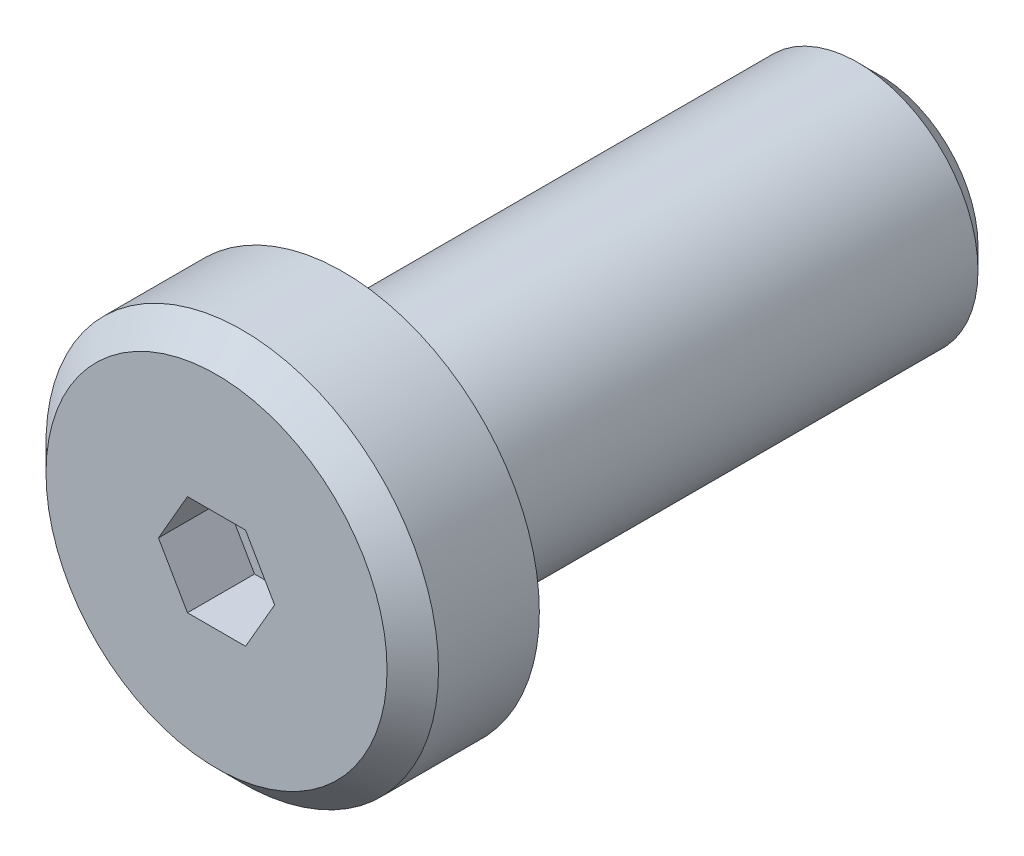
ISO-10303-21;
HEADER;
FILE_DESCRIPTION(('STEP AP214'),'2;1');
FILE_NAME('part.step','',(''),(''),'','','');
FILE_SCHEMA(('AUTOMOTIVE_DESIGN { 1 0 10303 214 1 1 1 1 }'));
ENDSEC;
DATA;
#1=APPLICATION_CONTEXT('core data for automotive mechanical design processes');
#2=APPLICATION_PROTOCOL_DEFINITION('international standard','automotive_design',2000,#1);
#3=PRODUCT_CONTEXT('',#1,'mechanical');
#4=PRODUCT('Part','Part','',(#3));
#5=PRODUCT_RELATED_PRODUCT_CATEGORY('part','',(#4));
#6=PRODUCT_DEFINITION_FORMATION('','',#4);
#7=PRODUCT_DEFINITION_CONTEXT('part definition',#1,'design');
#8=PRODUCT_DEFINITION('design','',#6,#7);
#9=PRODUCT_DEFINITION_SHAPE('','',#8);
#10=(LENGTH_UNIT() NAMED_UNIT(*) SI_UNIT(.MILLI.,.METRE.));
#11=(NAMED_UNIT(*) PLANE_ANGLE_UNIT() SI_UNIT($,.RADIAN.));
#12=(NAMED_UNIT(*) SI_UNIT($,.STERADIAN.) SOLID_ANGLE_UNIT());
#13=UNCERTAINTY_MEASURE_WITH_UNIT(LENGTH_MEASURE(1.E-05),#10,'distance_accuracy_value','');
#14=(GEOMETRIC_REPRESENTATION_CONTEXT(3) GLOBAL_UNCERTAINTY_ASSIGNED_CONTEXT((#13)) GLOBAL_UNIT_ASSIGNED_CONTEXT((#10,
#11,#12)) REPRESENTATION_CONTEXT('',''));
#15=CARTESIAN_POINT('',(0.,0.,0.));
#16=DIRECTION('',(0.,0.,1.));
#17=DIRECTION('',(1.,0.,0.));
#18=AXIS2_PLACEMENT_3D('',#15,#16,#17);
#19=CARTESIAN_POINT('',(0.,0.,-1.49859999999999));
#20=DIRECTION('',(0.,0.,1.));
#21=DIRECTION('',(1.,0.,0.));
#22=AXIS2_PLACEMENT_3D('',#19,#20,#21);
#23=CYLINDRICAL_SURFACE('',#22,2.3241);
#24=CARTESIAN_POINT('',(0.,0.,-0.304799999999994));
#25=DIRECTION('',(0.,0.,1.));
#26=DIRECTION('',(1.,0.,0.));
#27=AXIS2_PLACEMENT_3D('',#24,#25,#26);
#28=CIRCLE('',#27,2.3241);
#29=CARTESIAN_POINT('',(2.3241,0.,-0.304799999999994));
#30=VERTEX_POINT('',#29);
#31=EDGE_CURVE('E11',#30,#30,#28,.F.);
#32=CARTESIAN_POINT('',(0.,0.,-1.49859999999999));
#33=DIRECTION('',(0.,0.,1.));
#34=DIRECTION('',(1.,0.,0.));
#35=AXIS2_PLACEMENT_3D('',#32,#33,#34);
#36=CIRCLE('',#35,2.3241);
#37=CARTESIAN_POINT('',(2.3241,0.,-1.49859999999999));
#38=VERTEX_POINT('',#37);
#39=EDGE_CURVE('E147',#38,#38,#36,.T.);
#40=CARTESIAN_POINT('',(2.3241,0.,-0.304799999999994));
#41=CARTESIAN_POINT('',(2.3241,0.,-0.317235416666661));
#42=CARTESIAN_POINT('',(2.3241,0.,-0.329670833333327));
#43=CARTESIAN_POINT('',(2.3241,0.,-0.35454166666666));
#44=CARTESIAN_POINT('',(2.3241,0.,-0.366977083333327));
#45=CARTESIAN_POINT('',(2.3241,0.,-0.39184791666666));
#46=CARTESIAN_POINT('',(2.3241,0.,-0.404283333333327));
#47=CARTESIAN_POINT('',(2.3241,0.,-0.42915416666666));
#48=CARTESIAN_POINT('',(2.3241,0.,-0.441589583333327));
#49=CARTESIAN_POINT('',(2.3241,0.,-0.46646041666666));
#50=CARTESIAN_POINT('',(2.3241,0.,-0.478895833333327));
#51=CARTESIAN_POINT('',(2.3241,0.,-0.50376666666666));
#52=CARTESIAN_POINT('',(2.3241,0.,-0.516202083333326));
#53=CARTESIAN_POINT('',(2.3241,0.,-0.54107291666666));
#54=CARTESIAN_POINT('',(2.3241,0.,-0.553508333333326));
#55=CARTESIAN_POINT('',(2.3241,0.,-0.57837916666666));
#56=CARTESIAN_POINT('',(2.3241,0.,-0.590814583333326));
#57=CARTESIAN_POINT('',(2.3241,0.,-0.615685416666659));
#58=CARTESIAN_POINT('',(2.3241,0.,-0.628120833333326));
#59=CARTESIAN_POINT('',(2.3241,0.,-0.652991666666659));
#60=CARTESIAN_POINT('',(2.3241,0.,-0.665427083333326));
#61=CARTESIAN_POINT('',(2.3241,0.,-0.690297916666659));
#62=CARTESIAN_POINT('',(2.3241,0.,-0.702733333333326));
#63=CARTESIAN_POINT('',(2.3241,0.,-0.727604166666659));
#64=CARTESIAN_POINT('',(2.3241,0.,-0.740039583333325));
#65=CARTESIAN_POINT('',(2.3241,0.,-0.764910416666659));
#66=CARTESIAN_POINT('',(2.3241,0.,-0.777345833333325));
#67=CARTESIAN_POINT('',(2.3241,0.,-0.802216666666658));
#68=CARTESIAN_POINT('',(2.3241,0.,-0.814652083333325));
#69=CARTESIAN_POINT('',(2.3241,0.,-0.839522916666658));
#70=CARTESIAN_POINT('',(2.3241,0.,-0.851958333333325));
#71=CARTESIAN_POINT('',(2.3241,0.,-0.876829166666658));
#72=CARTESIAN_POINT('',(2.3241,0.,-0.889264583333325));
#73=CARTESIAN_POINT('',(2.3241,0.,-0.914135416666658));
#74=CARTESIAN_POINT('',(2.3241,0.,-0.926570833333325));
#75=CARTESIAN_POINT('',(2.3241,0.,-0.951441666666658));
#76=CARTESIAN_POINT('',(2.3241,0.,-0.963877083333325));
#77=CARTESIAN_POINT('',(2.3241,0.,-0.988747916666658));
#78=CARTESIAN_POINT('',(2.3241,0.,-1.00118333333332));
#79=CARTESIAN_POINT('',(2.3241,0.,-1.02605416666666));
#80=CARTESIAN_POINT('',(2.3241,0.,-1.03848958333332));
#81=CARTESIAN_POINT('',(2.3241,0.,-1.06336041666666));
#82=CARTESIAN_POINT('',(2.3241,0.,-1.07579583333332));
#83=CARTESIAN_POINT('',(2.3241,0.,-1.10066666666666));
#84=CARTESIAN_POINT('',(2.3241,0.,-1.11310208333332));
#85=CARTESIAN_POINT('',(2.3241,0.,-1.13797291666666));
#86=CARTESIAN_POINT('',(2.3241,0.,-1.15040833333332));
#87=CARTESIAN_POINT('',(2.3241,0.,-1.17527916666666));
#88=CARTESIAN_POINT('',(2.3241,0.,-1.18771458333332));
#89=CARTESIAN_POINT('',(2.3241,0.,-1.21258541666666));
#90=CARTESIAN_POINT('',(2.3241,0.,-1.22502083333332));
#91=CARTESIAN_POINT('',(2.3241,0.,-1.24989166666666));
#92=CARTESIAN_POINT('',(2.3241,0.,-1.26232708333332));
#93=CARTESIAN_POINT('',(2.3241,0.,-1.28719791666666));
#94=CARTESIAN_POINT('',(2.3241,0.,-1.29963333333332));
#95=CARTESIAN_POINT('',(2.3241,0.,-1.32450416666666));
#96=CARTESIAN_POINT('',(2.3241,0.,-1.33693958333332));
#97=CARTESIAN_POINT('',(2.3241,0.,-1.36181041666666));
#98=CARTESIAN_POINT('',(2.3241,0.,-1.37424583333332));
#99=CARTESIAN_POINT('',(2.3241,0.,-1.39911666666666));
#100=CARTESIAN_POINT('',(2.3241,0.,-1.41155208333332));
#101=CARTESIAN_POINT('',(2.3241,0.,-1.43642291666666));
#102=CARTESIAN_POINT('',(2.3241,0.,-1.44885833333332));
#103=CARTESIAN_POINT('',(2.3241,0.,-1.47372916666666));
#104=CARTESIAN_POINT('',(2.3241,0.,-1.48616458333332));
#105=CARTESIAN_POINT('',(2.3241,0.,-1.49859999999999));
#106=B_SPLINE_CURVE_WITH_KNOTS('',3,(#40,#41,#42,#43,#44,#45,#46,#47,#48,#49,#50,#51,#52,#53,
#54,#55,#56,#57,#58,#59,#60,#61,#62,#63,#64,#65,#66,#67,#68,#69,#70,#71,#72,#73,#74,#75,#76,#77,
#78,#79,#80,#81,#82,#83,#84,#85,#86,#87,#88,#89,#90,#91,#92,#93,#94,#95,#96,#97,#98,#99,#100,
#101,#102,#103,#104,#105),.UNSPECIFIED.,.F.,.F.,(4,2,2,2,2,2,2,2,2,2,2,2,2,2,2,2,2,2,2,2,2,2,2,
2,2,2,2,2,2,2,2,2,4),(0.,0.0373062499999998,0.0746124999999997,0.11191875,0.149224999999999,
0.186531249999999,0.223837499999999,0.261143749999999,0.298449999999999,0.335756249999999,
0.373062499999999,0.410368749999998,0.447674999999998,0.484981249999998,0.522287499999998,
0.559593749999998,0.596899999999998,0.634206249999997,0.671512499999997,0.708818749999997,
0.746124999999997,0.783431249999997,0.820737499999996,0.858043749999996,0.895349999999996,
0.932656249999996,0.969962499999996,1.00726875,1.044575,1.08188125,1.1191875,1.15649375,1.1938),.UNSPECIFIED.);
#107=EDGE_CURVE('BSEAM45',#30,#38,#106,.T.);
#108=ORIENTED_EDGE('',*,*,#31,.T.);
#109=ORIENTED_EDGE('',*,*,#39,.T.);
#110=ORIENTED_EDGE('',*,*,#107,.T.);
#111=ORIENTED_EDGE('',*,*,#107,.F.);
#112=EDGE_LOOP('',(#108,#110,#109,#111));
#113=FACE_BOUND('',#112,.T.);
#114=ADVANCED_FACE('F45',(#113),#23,.T.);
#115=CARTESIAN_POINT('',(0.,0.,-1.49859999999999));
#116=DIRECTION('',(0.,0.,1.));
#117=DIRECTION('',(1.,0.,0.));
#118=AXIS2_PLACEMENT_3D('',#115,#116,#117);
#119=PLANE('',#118);
#120=CARTESIAN_POINT('',(0.,0.,-1.49859999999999));
#121=DIRECTION('',(0.,0.,1.));
#122=DIRECTION('',(1.,0.,0.));
#123=AXIS2_PLACEMENT_3D('',#120,#121,#122);
#124=CIRCLE('',#123,1.4224);
#125=CARTESIAN_POINT('',(1.4224,0.,-1.49859999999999));
#126=VERTEX_POINT('',#125);
#127=EDGE_CURVE('E155',#126,#126,#124,.F.);
#128=ORIENTED_EDGE('',*,*,#127,.F.);
#129=EDGE_LOOP('',(#128));
#130=FACE_BOUND('',#129,.T.);
#131=ORIENTED_EDGE('',*,*,#39,.F.);
#132=EDGE_LOOP('',(#131));
#133=FACE_BOUND('',#132,.T.);
#134=ADVANCED_FACE('F178',(#130,#133),#119,.F.);
#135=CARTESIAN_POINT('',(0.,0.,0.));
#136=DIRECTION('',(0.,0.,1.));
#137=DIRECTION('',(1.,0.,0.));
#138=AXIS2_PLACEMENT_3D('',#135,#136,#137);
#139=PLANE('',#138);
#140=CARTESIAN_POINT('',(0.,0.,0.));
#141=DIRECTION('',(0.,0.,1.));
#142=DIRECTION('',(1.,0.,0.));
#143=AXIS2_PLACEMENT_3D('',#140,#141,#142);
#144=CIRCLE('',#143,2.0193);
#145=CARTESIAN_POINT('',(2.0193,0.,0.));
#146=VERTEX_POINT('',#145);
#147=EDGE_CURVE('E53',#146,#146,#144,.T.);
#148=ORIENTED_EDGE('',*,*,#147,.T.);
#149=EDGE_LOOP('',(#148));
#150=FACE_BOUND('',#149,.T.);
#151=DIRECTION('',(0.5,0.866025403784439,0.));
#152=VECTOR('',#151,1.);
#153=CARTESIAN_POINT('',(0.343887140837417,-0.595630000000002,0.));
#154=LINE('',#153,#152);
#155=CARTESIAN_POINT('',(0.343887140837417,-0.595630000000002,0.));
#156=VERTEX_POINT('',#155);
#157=CARTESIAN_POINT('',(0.687774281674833,0.,0.));
#158=VERTEX_POINT('',#157);
#159=EDGE_CURVE('E60',#156,#158,#154,.T.);
#160=ORIENTED_EDGE('',*,*,#159,.F.);
#161=DIRECTION('',(1.,0.,0.));
#162=VECTOR('',#161,1.);
#163=CARTESIAN_POINT('',(-0.343887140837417,-0.595630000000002,0.));
#164=LINE('',#163,#162);
#165=CARTESIAN_POINT('',(-0.343887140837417,-0.595630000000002,0.));
#166=VERTEX_POINT('',#165);
#167=EDGE_CURVE('E143',#166,#156,#164,.T.);
#168=ORIENTED_EDGE('',*,*,#167,.F.);
#169=DIRECTION('',(0.5,-0.866025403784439,0.));
#170=VECTOR('',#169,1.);
#171=CARTESIAN_POINT('',(-0.687774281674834,0.,0.));
#172=LINE('',#171,#170);
#173=CARTESIAN_POINT('',(-0.687774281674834,0.,0.));
#174=VERTEX_POINT('',#173);
#175=EDGE_CURVE('E141',#174,#166,#172,.T.);
#176=ORIENTED_EDGE('',*,*,#175,.F.);
#177=DIRECTION('',(-0.5,-0.866025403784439,0.));
#178=VECTOR('',#177,1.);
#179=CARTESIAN_POINT('',(-0.343887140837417,0.595629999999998,0.));
#180=LINE('',#179,#178);
#181=CARTESIAN_POINT('',(-0.343887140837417,0.595629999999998,0.));
#182=VERTEX_POINT('',#181);
#183=EDGE_CURVE('E108',#182,#174,#180,.T.);
#184=ORIENTED_EDGE('',*,*,#183,.F.);
#185=DIRECTION('',(-1.,0.,0.));
#186=VECTOR('',#185,1.);
#187=CARTESIAN_POINT('',(0.343887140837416,0.595629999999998,0.));
#188=LINE('',#187,#186);
#189=CARTESIAN_POINT('',(0.343887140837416,0.595629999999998,0.));
#190=VERTEX_POINT('',#189);
#191=EDGE_CURVE('E137',#190,#182,#188,.T.);
#192=ORIENTED_EDGE('',*,*,#191,.F.);
#193=DIRECTION('',(-0.5,0.866025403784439,0.));
#194=VECTOR('',#193,1.);
#195=CARTESIAN_POINT('',(0.687774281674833,0.,0.));
#196=LINE('',#195,#194);
#197=EDGE_CURVE('E134',#158,#190,#196,.T.);
#198=ORIENTED_EDGE('',*,*,#197,.F.);
#199=EDGE_LOOP('',(#160,#168,#176,#184,#192,#198));
#200=FACE_BOUND('',#199,.T.);
#201=ADVANCED_FACE('F166',(#150,#200),#139,.T.);
#202=CARTESIAN_POINT('',(0.,0.,-7.84860000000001));
#203=DIRECTION('',(0.,0.,1.));
#204=DIRECTION('',(1.,0.,0.));
#205=AXIS2_PLACEMENT_3D('',#202,#203,#204);
#206=CYLINDRICAL_SURFACE('',#205,1.4224);
#207=CARTESIAN_POINT('',(0.,0.,-7.59460000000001));
#208=DIRECTION('',(0.,0.,-1.));
#209=DIRECTION('',(-1.,0.,0.));
#210=AXIS2_PLACEMENT_3D('',#207,#208,#209);
#211=CIRCLE('',#210,1.4224);
#212=CARTESIAN_POINT('',(1.4224,0.,-7.59460000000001));
#213=VERTEX_POINT('',#212);
#214=EDGE_CURVE('E161',#213,#213,#211,.F.);
#215=CARTESIAN_POINT('',(1.4224,0.,-7.59460000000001));
#216=CARTESIAN_POINT('',(1.4224,0.,-7.53110000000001));
#217=CARTESIAN_POINT('',(1.4224,0.,-7.46760000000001));
#218=CARTESIAN_POINT('',(1.4224,0.,-7.34060000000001));
#219=CARTESIAN_POINT('',(1.4224,0.,-7.27710000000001));
#220=CARTESIAN_POINT('',(1.4224,0.,-7.1501));
#221=CARTESIAN_POINT('',(1.4224,0.,-7.0866));
#222=CARTESIAN_POINT('',(1.4224,0.,-6.9596));
#223=CARTESIAN_POINT('',(1.4224,0.,-6.89610000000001));
#224=CARTESIAN_POINT('',(1.4224,0.,-6.7691));
#225=CARTESIAN_POINT('',(1.4224,0.,-6.7056));
#226=CARTESIAN_POINT('',(1.4224,0.,-6.5786));
#227=CARTESIAN_POINT('',(1.4224,0.,-6.5151));
#228=CARTESIAN_POINT('',(1.4224,0.,-6.3881));
#229=CARTESIAN_POINT('',(1.4224,0.,-6.3246));
#230=CARTESIAN_POINT('',(1.4224,0.,-6.1976));
#231=CARTESIAN_POINT('',(1.4224,0.,-6.1341));
#232=CARTESIAN_POINT('',(1.4224,0.,-6.0071));
#233=CARTESIAN_POINT('',(1.4224,0.,-5.9436));
#234=CARTESIAN_POINT('',(1.4224,0.,-5.8166));
#235=CARTESIAN_POINT('',(1.4224,0.,-5.7531));
#236=CARTESIAN_POINT('',(1.4224,0.,-5.6261));
#237=CARTESIAN_POINT('',(1.4224,0.,-5.5626));
#238=CARTESIAN_POINT('',(1.4224,0.,-5.4356));
#239=CARTESIAN_POINT('',(1.4224,0.,-5.3721));
#240=CARTESIAN_POINT('',(1.4224,0.,-5.2451));
#241=CARTESIAN_POINT('',(1.4224,0.,-5.1816));
#242=CARTESIAN_POINT('',(1.4224,0.,-5.0546));
#243=CARTESIAN_POINT('',(1.4224,0.,-4.9911));
#244=CARTESIAN_POINT('',(1.4224,0.,-4.8641));
#245=CARTESIAN_POINT('',(1.4224,0.,-4.8006));
#246=CARTESIAN_POINT('',(1.4224,0.,-4.6736));
#247=CARTESIAN_POINT('',(1.4224,0.,-4.6101));
#248=CARTESIAN_POINT('',(1.4224,0.,-4.4831));
#249=CARTESIAN_POINT('',(1.4224,0.,-4.4196));
#250=CARTESIAN_POINT('',(1.4224,0.,-4.2926));
#251=CARTESIAN_POINT('',(1.4224,0.,-4.2291));
#252=CARTESIAN_POINT('',(1.4224,0.,-4.1021));
#253=CARTESIAN_POINT('',(1.4224,0.,-4.0386));
#254=CARTESIAN_POINT('',(1.4224,0.,-3.9116));
#255=CARTESIAN_POINT('',(1.4224,0.,-3.8481));
#256=CARTESIAN_POINT('',(1.4224,0.,-3.72109999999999));
#257=CARTESIAN_POINT('',(1.4224,0.,-3.65759999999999));
#258=CARTESIAN_POINT('',(1.4224,0.,-3.53059999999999));
#259=CARTESIAN_POINT('',(1.4224,0.,-3.46709999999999));
#260=CARTESIAN_POINT('',(1.4224,0.,-3.34009999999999));
#261=CARTESIAN_POINT('',(1.4224,0.,-3.27659999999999));
#262=CARTESIAN_POINT('',(1.4224,0.,-3.14959999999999));
#263=CARTESIAN_POINT('',(1.4224,0.,-3.08609999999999));
#264=CARTESIAN_POINT('',(1.4224,0.,-2.95909999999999));
#265=CARTESIAN_POINT('',(1.4224,0.,-2.89559999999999));
#266=CARTESIAN_POINT('',(1.4224,0.,-2.76859999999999));
#267=CARTESIAN_POINT('',(1.4224,0.,-2.70509999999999));
#268=CARTESIAN_POINT('',(1.4224,0.,-2.57809999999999));
#269=CARTESIAN_POINT('',(1.4224,0.,-2.51459999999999));
#270=CARTESIAN_POINT('',(1.4224,0.,-2.38759999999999));
#271=CARTESIAN_POINT('',(1.4224,0.,-2.32409999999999));
#272=CARTESIAN_POINT('',(1.4224,0.,-2.19709999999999));
#273=CARTESIAN_POINT('',(1.4224,0.,-2.13359999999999));
#274=CARTESIAN_POINT('',(1.4224,0.,-2.00659999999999));
#275=CARTESIAN_POINT('',(1.4224,0.,-1.94309999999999));
#276=CARTESIAN_POINT('',(1.4224,0.,-1.81609999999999));
#277=CARTESIAN_POINT('',(1.4224,0.,-1.75259999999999));
#278=CARTESIAN_POINT('',(1.4224,0.,-1.62559999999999));
#279=CARTESIAN_POINT('',(1.4224,0.,-1.56209999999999));
#280=CARTESIAN_POINT('',(1.4224,0.,-1.49859999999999));
#281=B_SPLINE_CURVE_WITH_KNOTS('',3,(#215,#216,#217,#218,#219,#220,#221,#222,#223,#224,#225,
#226,#227,#228,#229,#230,#231,#232,#233,#234,#235,#236,#237,#238,#239,#240,#241,#242,#243,#244,
#245,#246,#247,#248,#249,#250,#251,#252,#253,#254,#255,#256,#257,#258,#259,#260,#261,#262,#263,
#264,#265,#266,#267,#268,#269,#270,#271,#272,#273,#274,#275,#276,#277,#278,#279,#280),
.UNSPECIFIED.,.F.,.F.,(4,2,2,2,2,2,2,2,2,2,2,2,2,2,2,2,2,2,2,2,2,2,2,2,2,2,2,2,2,2,2,2,4),(0.,
0.190500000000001,0.381000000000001,0.571500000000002,0.762000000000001,0.952500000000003,1.143,
1.3335,1.524,1.71450000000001,1.905,2.09550000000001,2.28600000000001,2.47650000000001,
2.66700000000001,2.85750000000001,3.04800000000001,3.23850000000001,3.42900000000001,
3.61950000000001,3.81000000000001,4.00050000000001,4.19100000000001,4.38150000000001,
4.57200000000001,4.76250000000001,4.95300000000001,5.14350000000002,5.33400000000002,
5.52450000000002,5.71500000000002,5.90550000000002,6.09600000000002),.UNSPECIFIED.);
#282=EDGE_CURVE('BSEAM189',#213,#126,#281,.T.);
#283=ORIENTED_EDGE('',*,*,#214,.T.);
#284=ORIENTED_EDGE('',*,*,#127,.T.);
#285=ORIENTED_EDGE('',*,*,#282,.T.);
#286=ORIENTED_EDGE('',*,*,#282,.F.);
#287=EDGE_LOOP('',(#283,#285,#284,#286));
#288=FACE_BOUND('',#287,.T.);
#289=ADVANCED_FACE('F189',(#288),#206,.T.);
#290=CARTESIAN_POINT('',(0.,0.,-7.84860000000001));
#291=DIRECTION('',(0.,0.,-1.));
#292=DIRECTION('',(-1.,0.,0.));
#293=AXIS2_PLACEMENT_3D('',#290,#291,#292);
#294=PLANE('',#293);
#295=CARTESIAN_POINT('',(0.,0.,-7.84860000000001));
#296=DIRECTION('',(0.,0.,-1.));
#297=DIRECTION('',(-1.,0.,0.));
#298=AXIS2_PLACEMENT_3D('',#295,#296,#297);
#299=CIRCLE('',#298,1.1684);
#300=CARTESIAN_POINT('',(1.1684,0.,-7.84860000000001));
#301=VERTEX_POINT('',#300);
#302=EDGE_CURVE('E158',#301,#301,#299,.T.);
#303=ORIENTED_EDGE('',*,*,#302,.T.);
#304=EDGE_LOOP('',(#303));
#305=FACE_BOUND('',#304,.T.);
#306=ADVANCED_FACE('F193',(#305),#294,.T.);
#307=CARTESIAN_POINT('',(0.343887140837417,-0.595630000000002,-0.79375000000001));
#308=DIRECTION('',(0.866025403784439,-0.5,0.));
#309=DIRECTION('',(0.5,0.866025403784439,0.));
#310=AXIS2_PLACEMENT_3D('',#307,#308,#309);
#311=PLANE('',#310);
#312=ORIENTED_EDGE('',*,*,#159,.T.);
#313=DIRECTION('',(0.,0.,1.));
#314=VECTOR('',#313,1.);
#315=CARTESIAN_POINT('',(0.687774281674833,0.,-0.79375000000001));
#316=LINE('',#315,#314);
#317=CARTESIAN_POINT('',(0.687774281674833,0.,-0.79375000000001));
#318=VERTEX_POINT('',#317);
#319=EDGE_CURVE('E90',#318,#158,#316,.T.);
#320=ORIENTED_EDGE('',*,*,#319,.F.);
#321=DIRECTION('',(0.5,0.866025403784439,0.));
#322=VECTOR('',#321,1.);
#323=CARTESIAN_POINT('',(0.343887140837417,-0.595630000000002,-0.79375000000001));
#324=LINE('',#323,#322);
#325=CARTESIAN_POINT('',(0.343887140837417,-0.595630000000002,-0.79375000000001));
#326=VERTEX_POINT('',#325);
#327=EDGE_CURVE('E145',#326,#318,#324,.T.);
#328=ORIENTED_EDGE('',*,*,#327,.F.);
#329=DIRECTION('',(0.,0.,1.));
#330=VECTOR('',#329,1.);
#331=CARTESIAN_POINT('',(0.343887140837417,-0.595630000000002,-0.79375000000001));
#332=LINE('',#331,#330);
#333=EDGE_CURVE('E68',#326,#156,#332,.T.);
#334=ORIENTED_EDGE('',*,*,#333,.T.);
#335=EDGE_LOOP('',(#312,#320,#328,#334));
#336=FACE_BOUND('',#335,.T.);
#337=ADVANCED_FACE('F197',(#336),#311,.F.);
#338=CARTESIAN_POINT('',(-0.343887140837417,-0.595630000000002,-0.79375000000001));
#339=DIRECTION('',(0.,-1.,0.));
#340=DIRECTION('',(1.,0.,0.));
#341=AXIS2_PLACEMENT_3D('',#338,#339,#340);
#342=PLANE('',#341);
#343=ORIENTED_EDGE('',*,*,#167,.T.);
#344=ORIENTED_EDGE('',*,*,#333,.F.);
#345=DIRECTION('',(1.,0.,0.));
#346=VECTOR('',#345,1.);
#347=CARTESIAN_POINT('',(-0.343887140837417,-0.595630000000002,-0.79375000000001));
#348=LINE('',#347,#346);
#349=CARTESIAN_POINT('',(-0.343887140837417,-0.595630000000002,-0.79375000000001));
#350=VERTEX_POINT('',#349);
#351=EDGE_CURVE('E120',#350,#326,#348,.T.);
#352=ORIENTED_EDGE('',*,*,#351,.F.);
#353=DIRECTION('',(0.,0.,1.));
#354=VECTOR('',#353,1.);
#355=CARTESIAN_POINT('',(-0.343887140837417,-0.595630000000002,-0.79375000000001));
#356=LINE('',#355,#354);
#357=EDGE_CURVE('E112',#350,#166,#356,.T.);
#358=ORIENTED_EDGE('',*,*,#357,.T.);
#359=EDGE_LOOP('',(#343,#344,#352,#358));
#360=FACE_BOUND('',#359,.T.);
#361=ADVANCED_FACE('F201',(#360),#342,.F.);
#362=CARTESIAN_POINT('',(-0.687774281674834,0.,-0.79375000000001));
#363=DIRECTION('',(-0.866025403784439,-0.5,0.));
#364=DIRECTION('',(0.5,-0.866025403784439,0.));
#365=AXIS2_PLACEMENT_3D('',#362,#363,#364);
#366=PLANE('',#365);
#367=ORIENTED_EDGE('',*,*,#175,.T.);
#368=ORIENTED_EDGE('',*,*,#357,.F.);
#369=DIRECTION('',(0.5,-0.866025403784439,0.));
#370=VECTOR('',#369,1.);
#371=CARTESIAN_POINT('',(-0.687774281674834,0.,-0.79375000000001));
#372=LINE('',#371,#370);
#373=CARTESIAN_POINT('',(-0.687774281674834,0.,-0.79375000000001));
#374=VERTEX_POINT('',#373);
#375=EDGE_CURVE('E116',#374,#350,#372,.T.);
#376=ORIENTED_EDGE('',*,*,#375,.F.);
#377=DIRECTION('',(0.,0.,1.));
#378=VECTOR('',#377,1.);
#379=CARTESIAN_POINT('',(-0.687774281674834,0.,-0.79375000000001));
#380=LINE('',#379,#378);
#381=EDGE_CURVE('E101',#374,#174,#380,.T.);
#382=ORIENTED_EDGE('',*,*,#381,.T.);
#383=EDGE_LOOP('',(#367,#368,#376,#382));
#384=FACE_BOUND('',#383,.T.);
#385=ADVANCED_FACE('F117',(#384),#366,.F.);
#386=CARTESIAN_POINT('',(-0.343887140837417,0.595629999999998,-0.79375000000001));
#387=DIRECTION('',(-0.866025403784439,0.5,0.));
#388=DIRECTION('',(-0.5,-0.866025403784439,0.));
#389=AXIS2_PLACEMENT_3D('',#386,#387,#388);
#390=PLANE('',#389);
#391=ORIENTED_EDGE('',*,*,#183,.T.);
#392=ORIENTED_EDGE('',*,*,#381,.F.);
#393=DIRECTION('',(-0.5,-0.866025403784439,0.));
#394=VECTOR('',#393,1.);
#395=CARTESIAN_POINT('',(-0.343887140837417,0.595629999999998,-0.79375000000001));
#396=LINE('',#395,#394);
#397=CARTESIAN_POINT('',(-0.343887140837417,0.595629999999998,-0.79375000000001));
#398=VERTEX_POINT('',#397);
#399=EDGE_CURVE('E105',#398,#374,#396,.T.);
#400=ORIENTED_EDGE('',*,*,#399,.F.);
#401=DIRECTION('',(0.,0.,1.));
#402=VECTOR('',#401,1.);
#403=CARTESIAN_POINT('',(-0.343887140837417,0.595629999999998,-0.79375000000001));
#404=LINE('',#403,#402);
#405=EDGE_CURVE('E113',#398,#182,#404,.T.);
#406=ORIENTED_EDGE('',*,*,#405,.T.);
#407=EDGE_LOOP('',(#391,#392,#400,#406));
#408=FACE_BOUND('',#407,.T.);
#409=ADVANCED_FACE('F103',(#408),#390,.F.);
#410=CARTESIAN_POINT('',(0.343887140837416,0.595629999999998,-0.79375000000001));
#411=DIRECTION('',(0.,1.,0.));
#412=DIRECTION('',(0.,0.,1.));
#413=AXIS2_PLACEMENT_3D('',#410,#411,#412);
#414=PLANE('',#413);
#415=ORIENTED_EDGE('',*,*,#191,.T.);
#416=ORIENTED_EDGE('',*,*,#405,.F.);
#417=DIRECTION('',(-1.,0.,0.));
#418=VECTOR('',#417,1.);
#419=CARTESIAN_POINT('',(0.343887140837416,0.595629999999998,-0.79375000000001));
#420=LINE('',#419,#418);
#421=CARTESIAN_POINT('',(0.343887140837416,0.595629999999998,-0.79375000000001));
#422=VERTEX_POINT('',#421);
#423=EDGE_CURVE('E126',#422,#398,#420,.T.);
#424=ORIENTED_EDGE('',*,*,#423,.F.);
#425=DIRECTION('',(0.,0.,1.));
#426=VECTOR('',#425,1.);
#427=CARTESIAN_POINT('',(0.343887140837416,0.595629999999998,-0.79375000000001));
#428=LINE('',#427,#426);
#429=EDGE_CURVE('E150',#422,#190,#428,.T.);
#430=ORIENTED_EDGE('',*,*,#429,.T.);
#431=EDGE_LOOP('',(#415,#416,#424,#430));
#432=FACE_BOUND('',#431,.T.);
#433=ADVANCED_FACE('F205',(#432),#414,.F.);
#434=CARTESIAN_POINT('',(0.687774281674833,0.,-0.79375000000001));
#435=DIRECTION('',(0.866025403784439,0.5,0.));
#436=DIRECTION('',(-0.5,0.866025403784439,0.));
#437=AXIS2_PLACEMENT_3D('',#434,#435,#436);
#438=PLANE('',#437);
#439=ORIENTED_EDGE('',*,*,#197,.T.);
#440=ORIENTED_EDGE('',*,*,#429,.F.);
#441=DIRECTION('',(-0.5,0.866025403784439,0.));
#442=VECTOR('',#441,1.);
#443=CARTESIAN_POINT('',(0.687774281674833,0.,-0.79375000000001));
#444=LINE('',#443,#442);
#445=EDGE_CURVE('E128',#318,#422,#444,.T.);
#446=ORIENTED_EDGE('',*,*,#445,.F.);
#447=ORIENTED_EDGE('',*,*,#319,.T.);
#448=EDGE_LOOP('',(#439,#440,#446,#447));
#449=FACE_BOUND('',#448,.T.);
#450=ADVANCED_FACE('F202',(#449),#438,.F.);
#451=CARTESIAN_POINT('',(0.343887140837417,-0.595630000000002,-0.79375000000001));
#452=DIRECTION('',(0.,0.,-1.));
#453=DIRECTION('',(-1.,0.,0.));
#454=AXIS2_PLACEMENT_3D('',#451,#452,#453);
#455=PLANE('',#454);
#456=ORIENTED_EDGE('',*,*,#327,.T.);
#457=ORIENTED_EDGE('',*,*,#445,.T.);
#458=ORIENTED_EDGE('',*,*,#423,.T.);
#459=ORIENTED_EDGE('',*,*,#399,.T.);
#460=ORIENTED_EDGE('',*,*,#375,.T.);
#461=ORIENTED_EDGE('',*,*,#351,.T.);
#462=EDGE_LOOP('',(#456,#457,#458,#459,#460,#461));
#463=FACE_BOUND('',#462,.T.);
#464=ADVANCED_FACE('F123',(#463),#455,.F.);
#465=CARTESIAN_POINT('',(0.,0.,-7.84860000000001));
#466=DIRECTION('',(0.,0.,1.));
#467=DIRECTION('',(1.,0.,0.));
#468=AXIS2_PLACEMENT_3D('',#465,#466,#467);
#469=CONICAL_SURFACE('',#468,1.1684,0.785398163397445);
#470=CARTESIAN_POINT('',(1.4224,0.,-7.59460000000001));
#471=CARTESIAN_POINT('',(1.41975416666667,0.,-7.59724583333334));
#472=CARTESIAN_POINT('',(1.41710833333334,0.,-7.59989166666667));
#473=CARTESIAN_POINT('',(1.41181666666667,0.,-7.60518333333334));
#474=CARTESIAN_POINT('',(1.40917083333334,0.,-7.60782916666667));
#475=CARTESIAN_POINT('',(1.40387916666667,0.,-7.61312083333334));
#476=CARTESIAN_POINT('',(1.40123333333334,0.,-7.61576666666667));
#477=CARTESIAN_POINT('',(1.39594166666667,0.,-7.62105833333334));
#478=CARTESIAN_POINT('',(1.39329583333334,0.,-7.62370416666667));
#479=CARTESIAN_POINT('',(1.38800416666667,0.,-7.62899583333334));
#480=CARTESIAN_POINT('',(1.38535833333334,0.,-7.63164166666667));
#481=CARTESIAN_POINT('',(1.38006666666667,0.,-7.63693333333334));
#482=CARTESIAN_POINT('',(1.37742083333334,0.,-7.63957916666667));
#483=CARTESIAN_POINT('',(1.37212916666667,0.,-7.64487083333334));
#484=CARTESIAN_POINT('',(1.36948333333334,0.,-7.64751666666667));
#485=CARTESIAN_POINT('',(1.36419166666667,0.,-7.65280833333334));
#486=CARTESIAN_POINT('',(1.36154583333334,0.,-7.65545416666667));
#487=CARTESIAN_POINT('',(1.35625416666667,0.,-7.66074583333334));
#488=CARTESIAN_POINT('',(1.35360833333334,0.,-7.66339166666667));
#489=CARTESIAN_POINT('',(1.34831666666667,0.,-7.66868333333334));
#490=CARTESIAN_POINT('',(1.34567083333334,0.,-7.67132916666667));
#491=CARTESIAN_POINT('',(1.34037916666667,0.,-7.67662083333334));
#492=CARTESIAN_POINT('',(1.33773333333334,0.,-7.67926666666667));
#493=CARTESIAN_POINT('',(1.33244166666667,0.,-7.68455833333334));
#494=CARTESIAN_POINT('',(1.32979583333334,0.,-7.68720416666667));
#495=CARTESIAN_POINT('',(1.32450416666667,0.,-7.69249583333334));
#496=CARTESIAN_POINT('',(1.32185833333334,0.,-7.69514166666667));
#497=CARTESIAN_POINT('',(1.31656666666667,0.,-7.70043333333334));
#498=CARTESIAN_POINT('',(1.31392083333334,0.,-7.70307916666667));
#499=CARTESIAN_POINT('',(1.30862916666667,0.,-7.70837083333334));
#500=CARTESIAN_POINT('',(1.30598333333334,0.,-7.71101666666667));
#501=CARTESIAN_POINT('',(1.30069166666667,0.,-7.71630833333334));
#502=CARTESIAN_POINT('',(1.29804583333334,0.,-7.71895416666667));
#503=CARTESIAN_POINT('',(1.29275416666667,0.,-7.72424583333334));
#504=CARTESIAN_POINT('',(1.29010833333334,0.,-7.72689166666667));
#505=CARTESIAN_POINT('',(1.28481666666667,0.,-7.73218333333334));
#506=CARTESIAN_POINT('',(1.28217083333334,0.,-7.73482916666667));
#507=CARTESIAN_POINT('',(1.27687916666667,0.,-7.74012083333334));
#508=CARTESIAN_POINT('',(1.27423333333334,0.,-7.74276666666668));
#509=CARTESIAN_POINT('',(1.26894166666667,0.,-7.74805833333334));
#510=CARTESIAN_POINT('',(1.26629583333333,0.,-7.75070416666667));
#511=CARTESIAN_POINT('',(1.26100416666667,0.,-7.75599583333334));
#512=CARTESIAN_POINT('',(1.25835833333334,0.,-7.75864166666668));
#513=CARTESIAN_POINT('',(1.25306666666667,0.,-7.76393333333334));
#514=CARTESIAN_POINT('',(1.25042083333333,0.,-7.76657916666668));
#515=CARTESIAN_POINT('',(1.24512916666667,0.,-7.77187083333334));
#516=CARTESIAN_POINT('',(1.24248333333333,0.,-7.77451666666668));
#517=CARTESIAN_POINT('',(1.23719166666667,0.,-7.77980833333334));
#518=CARTESIAN_POINT('',(1.23454583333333,0.,-7.78245416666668));
#519=CARTESIAN_POINT('',(1.22925416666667,0.,-7.78774583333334));
#520=CARTESIAN_POINT('',(1.22660833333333,0.,-7.79039166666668));
#521=CARTESIAN_POINT('',(1.22131666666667,0.,-7.79568333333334));
#522=CARTESIAN_POINT('',(1.21867083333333,0.,-7.79832916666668));
#523=CARTESIAN_POINT('',(1.21337916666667,0.,-7.80362083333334));
#524=CARTESIAN_POINT('',(1.21073333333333,0.,-7.80626666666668));
#525=CARTESIAN_POINT('',(1.20544166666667,0.,-7.81155833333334));
#526=CARTESIAN_POINT('',(1.20279583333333,0.,-7.81420416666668));
#527=CARTESIAN_POINT('',(1.19750416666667,0.,-7.81949583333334));
#528=CARTESIAN_POINT('',(1.19485833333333,0.,-7.82214166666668));
#529=CARTESIAN_POINT('',(1.18956666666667,0.,-7.82743333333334));
#530=CARTESIAN_POINT('',(1.18692083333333,0.,-7.83007916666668));
#531=CARTESIAN_POINT('',(1.18162916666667,0.,-7.83537083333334));
#532=CARTESIAN_POINT('',(1.17898333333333,0.,-7.83801666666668));
#533=CARTESIAN_POINT('',(1.17369166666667,0.,-7.84330833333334));
#534=CARTESIAN_POINT('',(1.17104583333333,0.,-7.84595416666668));
#535=CARTESIAN_POINT('',(1.1684,0.,-7.84860000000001));
#536=B_SPLINE_CURVE_WITH_KNOTS('',3,(#470,#471,#472,#473,#474,#475,#476,#477,#478,#479,#480,
#481,#482,#483,#484,#485,#486,#487,#488,#489,#490,#491,#492,#493,#494,#495,#496,#497,#498,#499,
#500,#501,#502,#503,#504,#505,#506,#507,#508,#509,#510,#511,#512,#513,#514,#515,#516,#517,#518,
#519,#520,#521,#522,#523,#524,#525,#526,#527,#528,#529,#530,#531,#532,#533,#534,#535),
.UNSPECIFIED.,.F.,.F.,(4,2,2,2,2,2,2,2,2,2,2,2,2,2,2,2,2,2,2,2,2,2,2,2,2,2,2,2,2,2,2,2,4),(0.,
0.0112253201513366,0.0224506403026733,0.0336759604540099,0.0449012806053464,0.056126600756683,
0.0673519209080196,0.0785772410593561,0.0898025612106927,0.101027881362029,0.112253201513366,
0.123478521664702,0.134703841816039,0.145929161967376,0.157154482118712,0.168379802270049,
0.179605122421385,0.190830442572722,0.202055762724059,0.213281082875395,0.224506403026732,
0.235731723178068,0.246957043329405,0.258182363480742,0.269407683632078,0.280633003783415,
0.291858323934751,0.303083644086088,0.314308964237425,0.325534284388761,0.336759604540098,
0.347984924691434,0.359210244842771),.UNSPECIFIED.);
#537=EDGE_CURVE('BSEAM170',#213,#301,#536,.T.);
#538=ORIENTED_EDGE('',*,*,#214,.F.);
#539=ORIENTED_EDGE('',*,*,#302,.F.);
#540=ORIENTED_EDGE('',*,*,#537,.T.);
#541=ORIENTED_EDGE('',*,*,#537,.F.);
#542=EDGE_LOOP('',(#538,#540,#539,#541));
#543=FACE_BOUND('',#542,.T.);
#544=ADVANCED_FACE('F170',(#543),#469,.T.);
#545=CARTESIAN_POINT('',(0.,0.,0.));
#546=DIRECTION('',(0.,0.,-1.));
#547=DIRECTION('',(-1.,0.,0.));
#548=AXIS2_PLACEMENT_3D('',#545,#546,#547);
#549=CONICAL_SURFACE('',#548,2.0193,0.785398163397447);
#550=ORIENTED_EDGE('',*,*,#31,.F.);
#551=EDGE_LOOP('',(#550));
#552=FACE_BOUND('',#551,.T.);
#553=ORIENTED_EDGE('',*,*,#147,.F.);
#554=EDGE_LOOP('',(#553));
#555=FACE_BOUND('',#554,.T.);
#556=ADVANCED_FACE('F47',(#552,#555),#549,.T.);
#557=CLOSED_SHELL('',(#114,#134,#201,#289,#306,#337,#361,#385,#409,#433,#450,#464,#544,#556));
#558=MANIFOLD_SOLID_BREP('B2',#557);
#559=ADVANCED_BREP_SHAPE_REPRESENTATION('',(#18,#558),#14);
#560=SHAPE_DEFINITION_REPRESENTATION(#9,#559);
ENDSEC;
END-ISO-10303-21;
